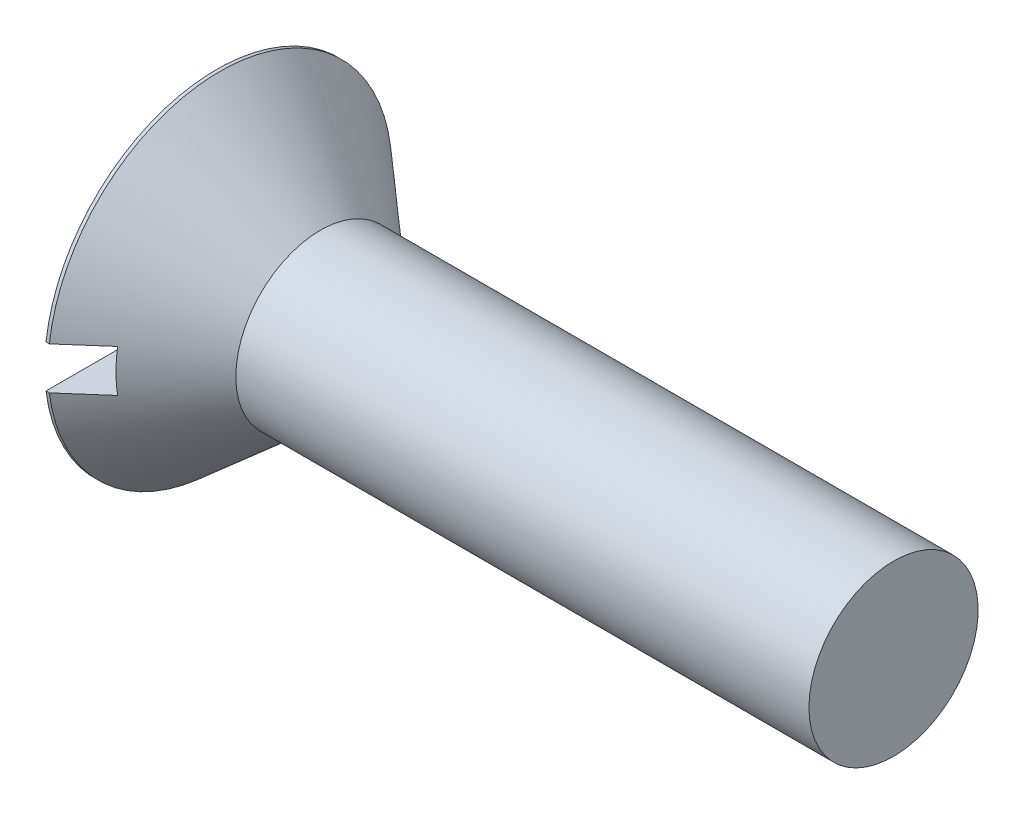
from build123d import *

# Parameters (mm, degrees)
SKETCH2_W         = 19.3548
SKETCH2_H         = 2.3876
SLOT_DEPTH        = 2.2352
CIRPATTERN1_COUNT = 2
CIRPATTERN1_ANGLE = 90


with BuildPart() as part:
    # BodySke → Base-Revolve (revolve)
    with BuildSketch(Plane.XY, mode=Mode.PRIVATE) as base_revolve_sk:
        Polygon((0, 0), (0, 9.6774), (0.188054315, 9.6774), (5.842, 4.7625), (38.1, 4.7625), (38.1, 0), align=None)
    revolve(base_revolve_sk.sketch.rotate(Axis((-6.35, 0, 0), (1, 0, 0)), 90), axis=Axis((-6.35, 0, 0), (1, 0, 0)))

    # Sketch2 → Slot (cut)
    with BuildSketch(Plane.ZY):
        Rectangle(SKETCH2_W, SKETCH2_H)
    extrude(amount=-SLOT_DEPTH, mode=Mode.SUBTRACT)

    # Sketch3 → Cross section 0
    with BuildSketch(Plane.ZY):
        with BuildLine():
            Line((-1.0922, 6.6421), (1.0922, 6.6421))
            Line((1.0922, 6.6421), (1.0922, -6.6421))
            Line((1.0922, -6.6421), (-1.0922, -6.6421))
            Line((-1.0922, -6.6421), (-1.0922, 6.6421))
        make_face()
    # Sketch4 → Cross section 1
    with BuildSketch(Plane.ZY.offset(-7.9756)):
        with BuildLine():
            Line((-0.5461, 0.5461), (0.5461, 0.5461))
            Line((0.5461, 0.5461), (0.5461, -0.5461))
            Line((0.5461, -0.5461), (-0.5461, -0.5461))
            Line((-0.5461, -0.5461), (-0.5461, 0.5461))
        make_face()
    cross = loft(mode=Mode.SUBTRACT)

    # CirPattern1: Cross ×2 about axis
    cirpattern1_axis = Axis((0, 0, 0), (1, 0, 0))
    for i in range(1, CIRPATTERN1_COUNT):
        add(cross.rotate(cirpattern1_axis, i * CIRPATTERN1_ANGLE / (CIRPATTERN1_COUNT - 1)), mode=Mode.SUBTRACT)


solid = part.part
